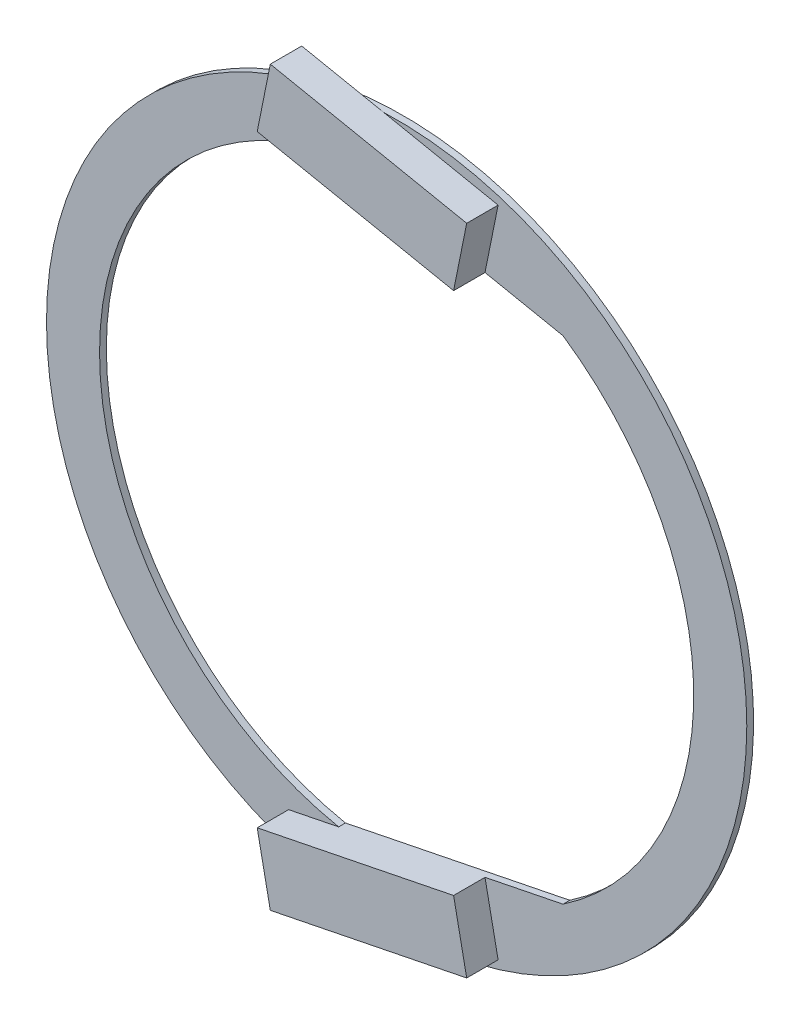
from build123d import *

# Parameters (mm, degrees)
BOSS_EXTRUDE1_DEPTH   = 4.7
BOSS_EXTRUDE1_2_DEPTH = 4.7
SKETCH2_R             = 52.3875
BOSS_EXTRUDE2_DEPTH   = 1.016


with BuildPart() as part:
    # Sketch1 → Boss-Extrude1 (new body)
    with BuildSketch(Plane.XY):
        Polygon((-14.201551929, 54.820368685), (-16.160689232, 45.104130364), (13.221551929, 39.179631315), (15.180689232, 48.895869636), align=None)
    extrude(amount=BOSS_EXTRUDE1_DEPTH)



with BuildPart() as body_2:
    # Sketch1 → Boss-Extrude1 2 (new body)
    with BuildSketch(Plane.XY):
        Polygon((13.221551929, -39.179631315), (15.180689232, -48.895869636), (-14.201551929, -54.820368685), (-16.160689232, -45.104130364), align=None)
    extrude(amount=BOSS_EXTRUDE1_2_DEPTH)


with BuildPart() as part_1:
    add(part.part)

    add(body_2.part)  # Boss-Extrude2 merges body 2
    # Sketch2 → Boss-Extrude2 (add)
    with BuildSketch(Plane(origin=(0, 0, 0), x_dir=(-1, 0, 0), z_dir=(0, 0, -1))):
        with Locations(Location((0, 0, 0), (0, 0, 87.861435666))):
            Circle(SKETCH2_R)
        with BuildLine():
            Line((8.676276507, 43.59500804), (-24.892084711, 36.826439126))
            ThreePointArc((-24.892084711, 36.826439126), (-44.45, 0), (-24.892084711, -36.826439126))
            Line((-24.892084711, -36.826439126), (8.676276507, -43.59500804))
            ThreePointArc((8.676276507, -43.59500804), (44.45, 0), (8.676276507, 43.59500804))
        make_face(mode=Mode.SUBTRACT)
    extrude(amount=BOSS_EXTRUDE2_DEPTH)


solid = part_1.part
